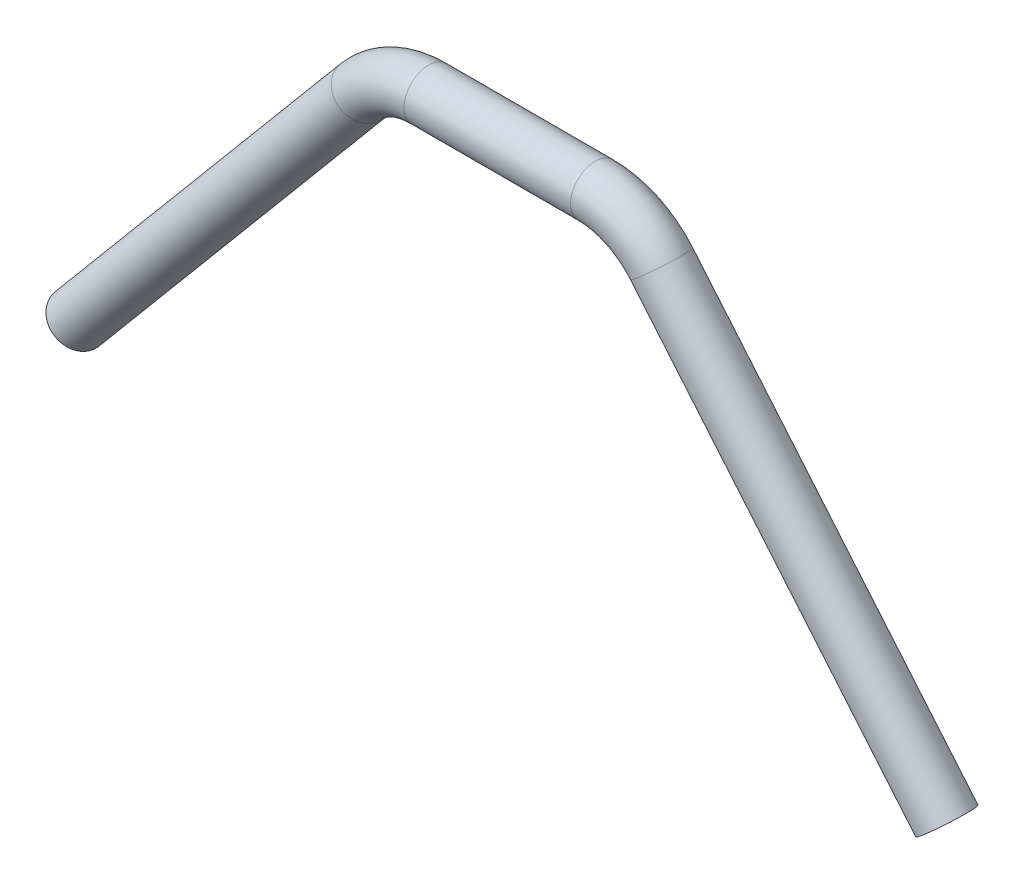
from build123d import *

# Parameters (mm, degrees)
SKIZZE2_R   = 10
SKIZZE2_R_2 = 8.5


with BuildPart() as part:
    # Austragung3: sweep along a path in Skizze1
    with BuildLine(Plane.XY) as austragung3_path:
        Line((0, 0), (-33.679231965, 0))
        ThreePointArc((-33.679231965, 0), (-48.470871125, -3.279227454), (-60.490787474, -12.502433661))
        Line((-60.490787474, -12.502433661), (-175.864944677, -150))
    # Skizze2 → Austragung3 (sweep)
    with BuildSketch(Plane(origin=(0, 0, 0), x_dir=(0, 0, -1), z_dir=(1, 0, 0))):
        Circle(SKIZZE2_R)
        Circle(SKIZZE2_R_2, mode=Mode.SUBTRACT)
    austragung3 = sweep(path=austragung3_path.line)

    # Spiegeln2: Austragung3 across plane
    add(austragung3.mirror(Plane(origin=(0, 0, 0), x_dir=(0, 0, 1), z_dir=(1, 0, 0))))


solid = part.part
